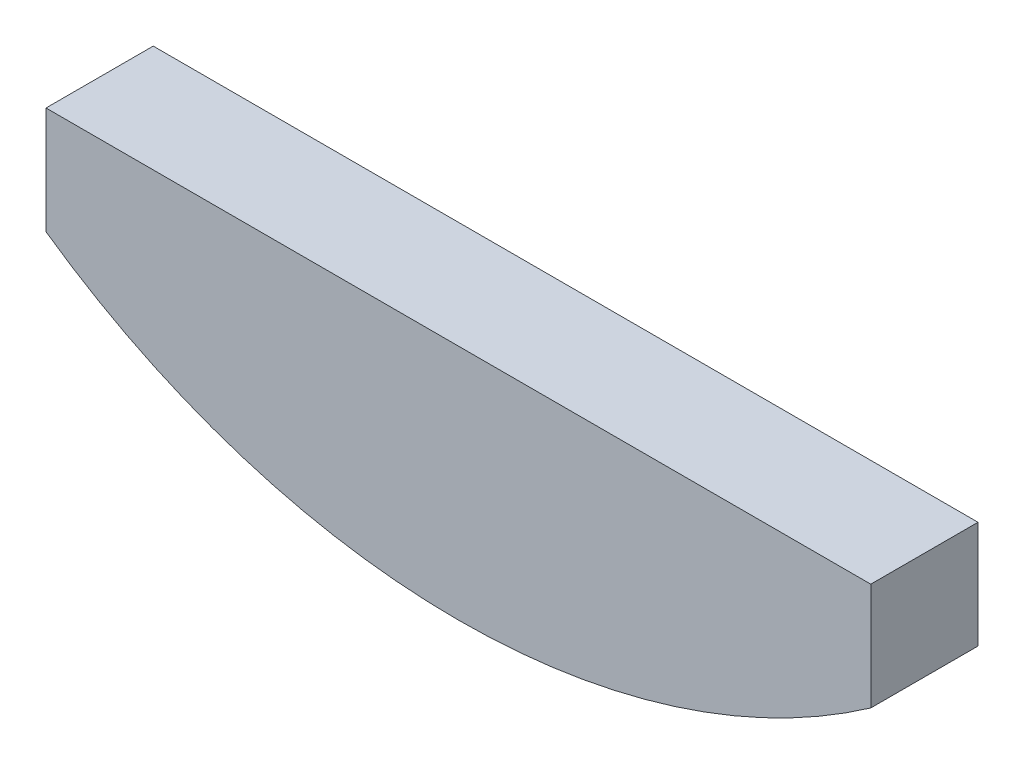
from build123d import *

# Parameters (mm, degrees)
SALIENTE_EXTRUIR1_DEPTH = 2.6


with BuildPart() as part:
    # Croquis1 → Saliente-Extruir1 (new body)
    with BuildSketch(Plane.XY):
        with BuildLine():
            Line((6.98766878, 27.482755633), (6.98766878, 24.882755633))
            ThreePointArc((6.98766878, 24.882755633), (-3.01233122, 21.728193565), (-13.01233122, 24.882755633))
            Line((-13.01233122, 24.882755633), (-13.01233122, 27.482755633))
            Line((-13.01233122, 27.482755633), (6.98766878, 27.482755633))
        make_face()
    extrude(amount=SALIENTE_EXTRUIR1_DEPTH)


solid = part.part
